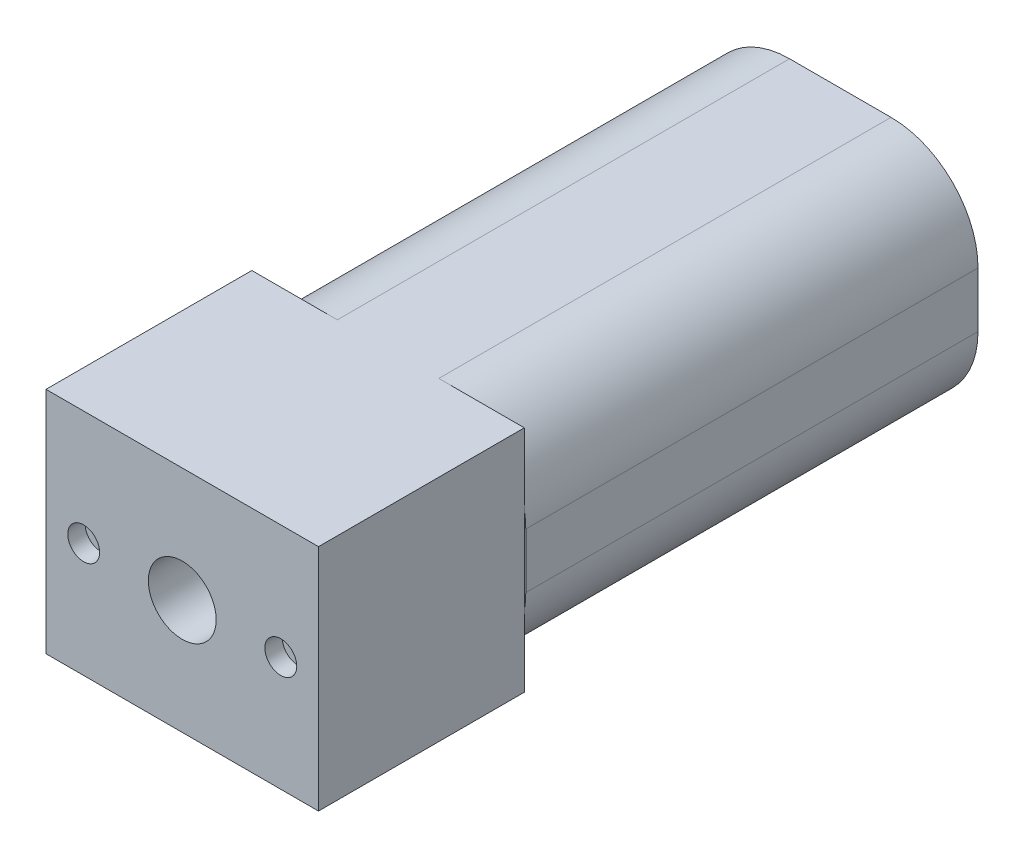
ISO-10303-21;
HEADER;
FILE_DESCRIPTION(('STEP AP214'),'2;1');
FILE_NAME('part.step','',(''),(''),'','','');
FILE_SCHEMA(('AUTOMOTIVE_DESIGN { 1 0 10303 214 1 1 1 1 }'));
ENDSEC;
DATA;
#1=APPLICATION_CONTEXT('core data for automotive mechanical design processes');
#2=APPLICATION_PROTOCOL_DEFINITION('international standard','automotive_design',2000,#1);
#3=PRODUCT_CONTEXT('',#1,'mechanical');
#4=PRODUCT('Part','Part','',(#3));
#5=PRODUCT_RELATED_PRODUCT_CATEGORY('part','',(#4));
#6=PRODUCT_DEFINITION_FORMATION('','',#4);
#7=PRODUCT_DEFINITION_CONTEXT('part definition',#1,'design');
#8=PRODUCT_DEFINITION('design','',#6,#7);
#9=PRODUCT_DEFINITION_SHAPE('','',#8);
#10=(LENGTH_UNIT() NAMED_UNIT(*) SI_UNIT(.MILLI.,.METRE.));
#11=(NAMED_UNIT(*) PLANE_ANGLE_UNIT() SI_UNIT($,.RADIAN.));
#12=(NAMED_UNIT(*) SI_UNIT($,.STERADIAN.) SOLID_ANGLE_UNIT());
#13=UNCERTAINTY_MEASURE_WITH_UNIT(LENGTH_MEASURE(1.E-05),#10,'distance_accuracy_value','');
#14=(GEOMETRIC_REPRESENTATION_CONTEXT(3) GLOBAL_UNCERTAINTY_ASSIGNED_CONTEXT((#13)) GLOBAL_UNIT_ASSIGNED_CONTEXT((#10,
#11,#12)) REPRESENTATION_CONTEXT('',''));
#15=CARTESIAN_POINT('',(0.,0.,0.));
#16=DIRECTION('',(0.,0.,1.));
#17=DIRECTION('',(1.,0.,0.));
#18=AXIS2_PLACEMENT_3D('',#15,#16,#17);
#19=CARTESIAN_POINT('',(-2.2225,1.2065,19.812));
#20=DIRECTION('',(0.,0.,-1.));
#21=DIRECTION('',(-1.,0.,0.));
#22=AXIS2_PLACEMENT_3D('',#19,#20,#21);
#23=PLANE('',#22);
#24=DIRECTION('',(0.,-1.,0.));
#25=VECTOR('',#24,1.);
#26=CARTESIAN_POINT('',(-5.969,5.0165,19.812));
#27=LINE('',#26,#25);
#28=CARTESIAN_POINT('',(-5.969,1.89920321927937,19.812));
#29=VERTEX_POINT('',#28);
#30=CARTESIAN_POINT('',(-5.969,-1.89920321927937,19.812));
#31=VERTEX_POINT('',#30);
#32=EDGE_CURVE('E11',#29,#31,#27,.T.);
#33=ORIENTED_EDGE('',*,*,#32,.F.);
#34=CARTESIAN_POINT('',(-2.2225,1.2065,19.812));
#35=DIRECTION('',(0.,0.,1.));
#36=DIRECTION('',(-1.,0.,0.));
#37=AXIS2_PLACEMENT_3D('',#34,#35,#36);
#38=CIRCLE('',#37,3.81);
#39=CARTESIAN_POINT('',(-6.0325,1.20649999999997,19.812));
#40=VERTEX_POINT('',#39);
#41=EDGE_CURVE('E177',#29,#40,#38,.T.);
#42=ORIENTED_EDGE('',*,*,#41,.T.);
#43=DIRECTION('',(0.,-1.,0.));
#44=VECTOR('',#43,1.);
#45=CARTESIAN_POINT('',(-6.0325,-1.20649999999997,19.812));
#46=LINE('',#45,#44);
#47=CARTESIAN_POINT('',(-6.0325,-1.20649999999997,19.812));
#48=VERTEX_POINT('',#47);
#49=EDGE_CURVE('E176',#40,#48,#46,.T.);
#50=ORIENTED_EDGE('',*,*,#49,.T.);
#51=CARTESIAN_POINT('',(-2.2225,-1.2065,19.812));
#52=DIRECTION('',(0.,0.,1.));
#53=DIRECTION('',(-1.,0.,0.));
#54=AXIS2_PLACEMENT_3D('',#51,#52,#53);
#55=CIRCLE('',#54,3.81);
#56=EDGE_CURVE('E179',#48,#31,#55,.T.);
#57=ORIENTED_EDGE('',*,*,#56,.T.);
#58=EDGE_LOOP('',(#33,#42,#50,#57));
#59=FACE_BOUND('',#58,.T.);
#60=ADVANCED_FACE('F33',(#59),#23,.F.);
#61=DIRECTION('',(0.,1.,0.));
#62=VECTOR('',#61,1.);
#63=CARTESIAN_POINT('',(5.969,5.0165,19.812));
#64=LINE('',#63,#62);
#65=CARTESIAN_POINT('',(5.969,-1.89920321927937,19.812));
#66=VERTEX_POINT('',#65);
#67=CARTESIAN_POINT('',(5.969,1.89920321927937,19.812));
#68=VERTEX_POINT('',#67);
#69=EDGE_CURVE('E42',#66,#68,#64,.T.);
#70=ORIENTED_EDGE('',*,*,#69,.F.);
#71=CARTESIAN_POINT('',(2.2225,-1.2065,19.812));
#72=DIRECTION('',(0.,0.,1.));
#73=DIRECTION('',(1.,0.,0.));
#74=AXIS2_PLACEMENT_3D('',#71,#72,#73);
#75=CIRCLE('',#74,3.81);
#76=CARTESIAN_POINT('',(6.0325,-1.2065,19.812));
#77=VERTEX_POINT('',#76);
#78=EDGE_CURVE('E181',#66,#77,#75,.T.);
#79=ORIENTED_EDGE('',*,*,#78,.T.);
#80=DIRECTION('',(0.,1.,0.));
#81=VECTOR('',#80,1.);
#82=CARTESIAN_POINT('',(6.0325,-1.20649999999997,19.812));
#83=LINE('',#82,#81);
#84=CARTESIAN_POINT('',(6.0325,1.20649999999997,19.812));
#85=VERTEX_POINT('',#84);
#86=EDGE_CURVE('E185',#77,#85,#83,.T.);
#87=ORIENTED_EDGE('',*,*,#86,.T.);
#88=CARTESIAN_POINT('',(2.2225,1.2065,19.812));
#89=DIRECTION('',(0.,0.,1.));
#90=DIRECTION('',(-1.,0.,0.));
#91=AXIS2_PLACEMENT_3D('',#88,#89,#90);
#92=CIRCLE('',#91,3.81);
#93=EDGE_CURVE('E188',#85,#68,#92,.T.);
#94=ORIENTED_EDGE('',*,*,#93,.T.);
#95=EDGE_LOOP('',(#70,#79,#87,#94));
#96=FACE_BOUND('',#95,.T.);
#97=ADVANCED_FACE('F300',(#96),#23,.F.);
#98=CARTESIAN_POINT('',(-2.2225,1.2065,19.812));
#99=DIRECTION('',(0.,0.,-1.));
#100=DIRECTION('',(-1.,0.,0.));
#101=AXIS2_PLACEMENT_3D('',#98,#99,#100);
#102=CYLINDRICAL_SURFACE('',#101,3.81);
#103=CARTESIAN_POINT('',(-2.2225,1.2065,0.));
#104=DIRECTION('',(0.,0.,1.));
#105=DIRECTION('',(-1.,0.,0.));
#106=AXIS2_PLACEMENT_3D('',#103,#104,#105);
#107=CIRCLE('',#106,3.81);
#108=CARTESIAN_POINT('',(-2.22249999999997,5.0165,0.));
#109=VERTEX_POINT('',#108);
#110=CARTESIAN_POINT('',(-6.0325,1.20649999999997,0.));
#111=VERTEX_POINT('',#110);
#112=EDGE_CURVE('E164',#109,#111,#107,.T.);
#113=ORIENTED_EDGE('',*,*,#112,.T.);
#114=DIRECTION('',(0.,0.,-1.));
#115=VECTOR('',#114,1.);
#116=CARTESIAN_POINT('',(-6.0325,1.20649999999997,19.812));
#117=LINE('',#116,#115);
#118=EDGE_CURVE('E37',#40,#111,#117,.T.);
#119=ORIENTED_EDGE('',*,*,#118,.F.);
#120=ORIENTED_EDGE('',*,*,#41,.F.);
#121=CARTESIAN_POINT('',(-2.22249999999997,5.0165,19.812));
#122=VERTEX_POINT('',#121);
#123=EDGE_CURVE('E173',#122,#29,#38,.T.);
#124=ORIENTED_EDGE('',*,*,#123,.F.);
#125=DIRECTION('',(0.,0.,-1.));
#126=VECTOR('',#125,1.);
#127=CARTESIAN_POINT('',(-2.22249999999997,5.0165,19.812));
#128=LINE('',#127,#126);
#129=EDGE_CURVE('E189',#122,#109,#128,.T.);
#130=ORIENTED_EDGE('',*,*,#129,.T.);
#131=EDGE_LOOP('',(#113,#119,#120,#124,#130));
#132=FACE_BOUND('',#131,.T.);
#133=ADVANCED_FACE('F35',(#132),#102,.T.);
#134=CARTESIAN_POINT('',(-6.0325,-1.20649999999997,19.812));
#135=DIRECTION('',(1.,0.,0.));
#136=DIRECTION('',(0.,0.,-1.));
#137=AXIS2_PLACEMENT_3D('',#134,#135,#136);
#138=PLANE('',#137);
#139=DIRECTION('',(0.,-1.,0.));
#140=VECTOR('',#139,1.);
#141=CARTESIAN_POINT('',(-6.0325,-1.20649999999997,0.));
#142=LINE('',#141,#140);
#143=CARTESIAN_POINT('',(-6.0325,-1.20649999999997,0.));
#144=VERTEX_POINT('',#143);
#145=EDGE_CURVE('E167',#111,#144,#142,.T.);
#146=ORIENTED_EDGE('',*,*,#145,.T.);
#147=DIRECTION('',(0.,0.,-1.));
#148=VECTOR('',#147,1.);
#149=CARTESIAN_POINT('',(-6.0325,-1.20649999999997,19.812));
#150=LINE('',#149,#148);
#151=EDGE_CURVE('E220',#48,#144,#150,.T.);
#152=ORIENTED_EDGE('',*,*,#151,.F.);
#153=ORIENTED_EDGE('',*,*,#49,.F.);
#154=ORIENTED_EDGE('',*,*,#118,.T.);
#155=EDGE_LOOP('',(#146,#152,#153,#154));
#156=FACE_BOUND('',#155,.T.);
#157=ADVANCED_FACE('F334',(#156),#138,.F.);
#158=CARTESIAN_POINT('',(-2.2225,-1.2065,19.812));
#159=DIRECTION('',(0.,0.,-1.));
#160=DIRECTION('',(-1.,0.,0.));
#161=AXIS2_PLACEMENT_3D('',#158,#159,#160);
#162=CYLINDRICAL_SURFACE('',#161,3.81);
#163=CARTESIAN_POINT('',(-2.2225,-1.2065,0.));
#164=DIRECTION('',(0.,0.,1.));
#165=DIRECTION('',(-1.,0.,0.));
#166=AXIS2_PLACEMENT_3D('',#163,#164,#165);
#167=CIRCLE('',#166,3.81);
#168=CARTESIAN_POINT('',(-2.22249999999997,-5.0165,0.));
#169=VERTEX_POINT('',#168);
#170=EDGE_CURVE('E192',#144,#169,#167,.T.);
#171=ORIENTED_EDGE('',*,*,#170,.T.);
#172=DIRECTION('',(0.,0.,-1.));
#173=VECTOR('',#172,1.);
#174=CARTESIAN_POINT('',(-2.22249999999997,-5.0165,19.812));
#175=LINE('',#174,#173);
#176=CARTESIAN_POINT('',(-2.22249999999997,-5.0165,19.812));
#177=VERTEX_POINT('',#176);
#178=EDGE_CURVE('E218',#177,#169,#175,.T.);
#179=ORIENTED_EDGE('',*,*,#178,.F.);
#180=EDGE_CURVE('E59',#31,#177,#55,.T.);
#181=ORIENTED_EDGE('',*,*,#180,.F.);
#182=ORIENTED_EDGE('',*,*,#56,.F.);
#183=ORIENTED_EDGE('',*,*,#151,.T.);
#184=EDGE_LOOP('',(#171,#179,#181,#182,#183));
#185=FACE_BOUND('',#184,.T.);
#186=ADVANCED_FACE('F332',(#185),#162,.T.);
#187=CARTESIAN_POINT('',(-2.22249999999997,-5.0165,19.812));
#188=DIRECTION('',(0.,1.,0.));
#189=DIRECTION('',(0.,0.,1.));
#190=AXIS2_PLACEMENT_3D('',#187,#188,#189);
#191=PLANE('',#190);
#192=DIRECTION('',(1.,0.,0.));
#193=VECTOR('',#192,1.);
#194=CARTESIAN_POINT('',(-2.22249999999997,-5.0165,0.));
#195=LINE('',#194,#193);
#196=CARTESIAN_POINT('',(2.22249999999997,-5.0165,0.));
#197=VERTEX_POINT('',#196);
#198=EDGE_CURVE('E194',#169,#197,#195,.T.);
#199=ORIENTED_EDGE('',*,*,#198,.T.);
#200=DIRECTION('',(0.,0.,-1.));
#201=VECTOR('',#200,1.);
#202=CARTESIAN_POINT('',(2.22249999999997,-5.0165,19.812));
#203=LINE('',#202,#201);
#204=CARTESIAN_POINT('',(2.22249999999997,-5.0165,19.812));
#205=VERTEX_POINT('',#204);
#206=EDGE_CURVE('E215',#205,#197,#203,.T.);
#207=ORIENTED_EDGE('',*,*,#206,.F.);
#208=DIRECTION('',(1.,0.,0.));
#209=VECTOR('',#208,1.);
#210=CARTESIAN_POINT('',(5.969,-5.0165,19.812));
#211=LINE('',#210,#209);
#212=CARTESIAN_POINT('',(5.969,-5.0165,19.812));
#213=VERTEX_POINT('',#212);
#214=EDGE_CURVE('E240',#205,#213,#211,.T.);
#215=ORIENTED_EDGE('',*,*,#214,.T.);
#216=DIRECTION('',(0.,0.,-1.));
#217=VECTOR('',#216,1.);
#218=CARTESIAN_POINT('',(5.969,-5.0165,28.829));
#219=LINE('',#218,#217);
#220=CARTESIAN_POINT('',(5.969,-5.0165,28.829));
#221=VERTEX_POINT('',#220);
#222=EDGE_CURVE('E145',#221,#213,#219,.T.);
#223=ORIENTED_EDGE('',*,*,#222,.F.);
#224=DIRECTION('',(1.,0.,0.));
#225=VECTOR('',#224,1.);
#226=CARTESIAN_POINT('',(5.969,-5.0165,28.829));
#227=LINE('',#226,#225);
#228=CARTESIAN_POINT('',(-5.969,-5.0165,28.829));
#229=VERTEX_POINT('',#228);
#230=EDGE_CURVE('E138',#229,#221,#227,.T.);
#231=ORIENTED_EDGE('',*,*,#230,.F.);
#232=DIRECTION('',(0.,0.,-1.));
#233=VECTOR('',#232,1.);
#234=CARTESIAN_POINT('',(-5.969,-5.0165,28.829));
#235=LINE('',#234,#233);
#236=CARTESIAN_POINT('',(-5.969,-5.0165,19.812));
#237=VERTEX_POINT('',#236);
#238=EDGE_CURVE('E143',#229,#237,#235,.T.);
#239=ORIENTED_EDGE('',*,*,#238,.T.);
#240=EDGE_CURVE('E236',#237,#177,#211,.T.);
#241=ORIENTED_EDGE('',*,*,#240,.T.);
#242=ORIENTED_EDGE('',*,*,#178,.T.);
#243=EDGE_LOOP('',(#199,#207,#215,#223,#231,#239,#241,#242));
#244=FACE_BOUND('',#243,.T.);
#245=ADVANCED_FACE('F140',(#244),#191,.F.);
#246=CARTESIAN_POINT('',(2.2225,-1.2065,19.812));
#247=DIRECTION('',(0.,0.,-1.));
#248=DIRECTION('',(-1.,0.,0.));
#249=AXIS2_PLACEMENT_3D('',#246,#247,#248);
#250=CYLINDRICAL_SURFACE('',#249,3.81);
#251=CARTESIAN_POINT('',(2.2225,-1.2065,0.));
#252=DIRECTION('',(0.,0.,1.));
#253=DIRECTION('',(1.,0.,0.));
#254=AXIS2_PLACEMENT_3D('',#251,#252,#253);
#255=CIRCLE('',#254,3.81);
#256=CARTESIAN_POINT('',(6.0325,-1.2065,0.));
#257=VERTEX_POINT('',#256);
#258=EDGE_CURVE('E196',#197,#257,#255,.T.);
#259=ORIENTED_EDGE('',*,*,#258,.T.);
#260=DIRECTION('',(0.,0.,-1.));
#261=VECTOR('',#260,1.);
#262=CARTESIAN_POINT('',(6.0325,-1.2065,19.812));
#263=LINE('',#262,#261);
#264=EDGE_CURVE('E212',#77,#257,#263,.T.);
#265=ORIENTED_EDGE('',*,*,#264,.F.);
#266=ORIENTED_EDGE('',*,*,#78,.F.);
#267=EDGE_CURVE('E182',#205,#66,#75,.T.);
#268=ORIENTED_EDGE('',*,*,#267,.F.);
#269=ORIENTED_EDGE('',*,*,#206,.T.);
#270=EDGE_LOOP('',(#259,#265,#266,#268,#269));
#271=FACE_BOUND('',#270,.T.);
#272=ADVANCED_FACE('F325',(#271),#250,.T.);
#273=CARTESIAN_POINT('',(6.0325,-1.20649999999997,19.812));
#274=DIRECTION('',(-1.,0.,0.));
#275=DIRECTION('',(0.,0.,1.));
#276=AXIS2_PLACEMENT_3D('',#273,#274,#275);
#277=PLANE('',#276);
#278=DIRECTION('',(0.,1.,0.));
#279=VECTOR('',#278,1.);
#280=CARTESIAN_POINT('',(6.0325,-1.20649999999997,0.));
#281=LINE('',#280,#279);
#282=CARTESIAN_POINT('',(6.0325,1.20649999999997,0.));
#283=VERTEX_POINT('',#282);
#284=EDGE_CURVE('E198',#257,#283,#281,.T.);
#285=ORIENTED_EDGE('',*,*,#284,.T.);
#286=DIRECTION('',(0.,0.,-1.));
#287=VECTOR('',#286,1.);
#288=CARTESIAN_POINT('',(6.0325,1.20649999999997,19.812));
#289=LINE('',#288,#287);
#290=EDGE_CURVE('E209',#85,#283,#289,.T.);
#291=ORIENTED_EDGE('',*,*,#290,.F.);
#292=ORIENTED_EDGE('',*,*,#86,.F.);
#293=ORIENTED_EDGE('',*,*,#264,.T.);
#294=EDGE_LOOP('',(#285,#291,#292,#293));
#295=FACE_BOUND('',#294,.T.);
#296=ADVANCED_FACE('F321',(#295),#277,.F.);
#297=CARTESIAN_POINT('',(2.2225,1.2065,19.812));
#298=DIRECTION('',(0.,0.,-1.));
#299=DIRECTION('',(-1.,0.,0.));
#300=AXIS2_PLACEMENT_3D('',#297,#298,#299);
#301=CYLINDRICAL_SURFACE('',#300,3.81);
#302=CARTESIAN_POINT('',(2.2225,1.2065,0.));
#303=DIRECTION('',(0.,0.,1.));
#304=DIRECTION('',(-1.,0.,0.));
#305=AXIS2_PLACEMENT_3D('',#302,#303,#304);
#306=CIRCLE('',#305,3.81);
#307=CARTESIAN_POINT('',(2.22249999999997,5.0165,0.));
#308=VERTEX_POINT('',#307);
#309=EDGE_CURVE('E200',#283,#308,#306,.T.);
#310=ORIENTED_EDGE('',*,*,#309,.T.);
#311=DIRECTION('',(0.,0.,-1.));
#312=VECTOR('',#311,1.);
#313=CARTESIAN_POINT('',(2.22249999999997,5.0165,19.812));
#314=LINE('',#313,#312);
#315=CARTESIAN_POINT('',(2.22249999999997,5.0165,19.812));
#316=VERTEX_POINT('',#315);
#317=EDGE_CURVE('E206',#316,#308,#314,.T.);
#318=ORIENTED_EDGE('',*,*,#317,.F.);
#319=EDGE_CURVE('E187',#68,#316,#92,.T.);
#320=ORIENTED_EDGE('',*,*,#319,.F.);
#321=ORIENTED_EDGE('',*,*,#93,.F.);
#322=ORIENTED_EDGE('',*,*,#290,.T.);
#323=EDGE_LOOP('',(#310,#318,#320,#321,#322));
#324=FACE_BOUND('',#323,.T.);
#325=ADVANCED_FACE('F317',(#324),#301,.T.);
#326=CARTESIAN_POINT('',(-2.22249999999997,5.0165,19.812));
#327=DIRECTION('',(0.,-1.,0.));
#328=DIRECTION('',(0.,0.,-1.));
#329=AXIS2_PLACEMENT_3D('',#326,#327,#328);
#330=PLANE('',#329);
#331=DIRECTION('',(-1.,0.,0.));
#332=VECTOR('',#331,1.);
#333=CARTESIAN_POINT('',(-2.22249999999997,5.0165,0.));
#334=LINE('',#333,#332);
#335=EDGE_CURVE('E202',#308,#109,#334,.T.);
#336=ORIENTED_EDGE('',*,*,#335,.T.);
#337=ORIENTED_EDGE('',*,*,#129,.F.);
#338=DIRECTION('',(-1.,0.,0.));
#339=VECTOR('',#338,1.);
#340=CARTESIAN_POINT('',(5.969,5.0165,19.812));
#341=LINE('',#340,#339);
#342=CARTESIAN_POINT('',(-5.969,5.0165,19.812));
#343=VERTEX_POINT('',#342);
#344=EDGE_CURVE('E235',#122,#343,#341,.T.);
#345=ORIENTED_EDGE('',*,*,#344,.T.);
#346=DIRECTION('',(0.,0.,-1.));
#347=VECTOR('',#346,1.);
#348=CARTESIAN_POINT('',(-5.969,5.0165,28.829));
#349=LINE('',#348,#347);
#350=CARTESIAN_POINT('',(-5.969,5.0165,28.829));
#351=VERTEX_POINT('',#350);
#352=EDGE_CURVE('E243',#351,#343,#349,.T.);
#353=ORIENTED_EDGE('',*,*,#352,.F.);
#354=DIRECTION('',(-1.,0.,0.));
#355=VECTOR('',#354,1.);
#356=CARTESIAN_POINT('',(5.969,5.0165,28.829));
#357=LINE('',#356,#355);
#358=CARTESIAN_POINT('',(5.969,5.0165,28.829));
#359=VERTEX_POINT('',#358);
#360=EDGE_CURVE('E154',#359,#351,#357,.T.);
#361=ORIENTED_EDGE('',*,*,#360,.F.);
#362=DIRECTION('',(0.,0.,-1.));
#363=VECTOR('',#362,1.);
#364=CARTESIAN_POINT('',(5.969,5.0165,28.829));
#365=LINE('',#364,#363);
#366=CARTESIAN_POINT('',(5.969,5.0165,19.812));
#367=VERTEX_POINT('',#366);
#368=EDGE_CURVE('E169',#359,#367,#365,.T.);
#369=ORIENTED_EDGE('',*,*,#368,.T.);
#370=EDGE_CURVE('E158',#367,#316,#341,.T.);
#371=ORIENTED_EDGE('',*,*,#370,.T.);
#372=ORIENTED_EDGE('',*,*,#317,.T.);
#373=EDGE_LOOP('',(#336,#337,#345,#353,#361,#369,#371,#372));
#374=FACE_BOUND('',#373,.T.);
#375=ADVANCED_FACE('F313',(#374),#330,.F.);
#376=CARTESIAN_POINT('',(-2.2225,1.2065,0.));
#377=DIRECTION('',(0.,0.,-1.));
#378=DIRECTION('',(-1.,0.,0.));
#379=AXIS2_PLACEMENT_3D('',#376,#377,#378);
#380=PLANE('',#379);
#381=ORIENTED_EDGE('',*,*,#112,.F.);
#382=ORIENTED_EDGE('',*,*,#335,.F.);
#383=ORIENTED_EDGE('',*,*,#309,.F.);
#384=ORIENTED_EDGE('',*,*,#284,.F.);
#385=ORIENTED_EDGE('',*,*,#258,.F.);
#386=ORIENTED_EDGE('',*,*,#198,.F.);
#387=ORIENTED_EDGE('',*,*,#170,.F.);
#388=ORIENTED_EDGE('',*,*,#145,.F.);
#389=EDGE_LOOP('',(#381,#382,#383,#384,#385,#386,#387,#388));
#390=FACE_BOUND('',#389,.T.);
#391=ADVANCED_FACE('F310',(#390),#380,.T.);
#392=CARTESIAN_POINT('',(0.,0.,19.812));
#393=DIRECTION('',(0.,0.,-1.));
#394=DIRECTION('',(-1.,0.,0.));
#395=AXIS2_PLACEMENT_3D('',#392,#393,#394);
#396=PLANE('',#395);
#397=ORIENTED_EDGE('',*,*,#344,.F.);
#398=ORIENTED_EDGE('',*,*,#123,.T.);
#399=EDGE_CURVE('E44',#343,#29,#27,.T.);
#400=ORIENTED_EDGE('',*,*,#399,.F.);
#401=EDGE_LOOP('',(#397,#398,#400));
#402=FACE_BOUND('',#401,.T.);
#403=ADVANCED_FACE('F296',(#402),#396,.T.);
#404=EDGE_CURVE('E45',#31,#237,#27,.T.);
#405=ORIENTED_EDGE('',*,*,#404,.F.);
#406=ORIENTED_EDGE('',*,*,#180,.T.);
#407=ORIENTED_EDGE('',*,*,#240,.F.);
#408=EDGE_LOOP('',(#405,#406,#407));
#409=FACE_BOUND('',#408,.T.);
#410=ADVANCED_FACE('F367',(#409),#396,.T.);
#411=ORIENTED_EDGE('',*,*,#214,.F.);
#412=ORIENTED_EDGE('',*,*,#267,.T.);
#413=EDGE_CURVE('E229',#213,#66,#64,.T.);
#414=ORIENTED_EDGE('',*,*,#413,.F.);
#415=EDGE_LOOP('',(#411,#412,#414));
#416=FACE_BOUND('',#415,.T.);
#417=ADVANCED_FACE('F297',(#416),#396,.T.);
#418=CARTESIAN_POINT('',(-5.969,5.0165,28.829));
#419=DIRECTION('',(1.,0.,0.));
#420=DIRECTION('',(0.,1.,0.));
#421=AXIS2_PLACEMENT_3D('',#418,#419,#420);
#422=PLANE('',#421);
#423=ORIENTED_EDGE('',*,*,#399,.T.);
#424=ORIENTED_EDGE('',*,*,#32,.T.);
#425=ORIENTED_EDGE('',*,*,#404,.T.);
#426=ORIENTED_EDGE('',*,*,#238,.F.);
#427=DIRECTION('',(0.,-1.,0.));
#428=VECTOR('',#427,1.);
#429=CARTESIAN_POINT('',(-5.969,5.0165,28.829));
#430=LINE('',#429,#428);
#431=EDGE_CURVE('E149',#351,#229,#430,.T.);
#432=ORIENTED_EDGE('',*,*,#431,.F.);
#433=ORIENTED_EDGE('',*,*,#352,.T.);
#434=EDGE_LOOP('',(#423,#424,#425,#426,#432,#433));
#435=FACE_BOUND('',#434,.T.);
#436=ADVANCED_FACE('F161',(#435),#422,.F.);
#437=CARTESIAN_POINT('',(5.969,5.0165,28.829));
#438=DIRECTION('',(-1.,0.,0.));
#439=DIRECTION('',(0.,0.,1.));
#440=AXIS2_PLACEMENT_3D('',#437,#438,#439);
#441=PLANE('',#440);
#442=ORIENTED_EDGE('',*,*,#413,.T.);
#443=ORIENTED_EDGE('',*,*,#69,.T.);
#444=EDGE_CURVE('E230',#68,#367,#64,.T.);
#445=ORIENTED_EDGE('',*,*,#444,.T.);
#446=ORIENTED_EDGE('',*,*,#368,.F.);
#447=DIRECTION('',(0.,1.,0.));
#448=VECTOR('',#447,1.);
#449=CARTESIAN_POINT('',(5.969,5.0165,28.829));
#450=LINE('',#449,#448);
#451=EDGE_CURVE('E148',#221,#359,#450,.T.);
#452=ORIENTED_EDGE('',*,*,#451,.F.);
#453=ORIENTED_EDGE('',*,*,#222,.T.);
#454=EDGE_LOOP('',(#442,#443,#445,#446,#452,#453));
#455=FACE_BOUND('',#454,.T.);
#456=ADVANCED_FACE('F276',(#455),#441,.F.);
#457=CARTESIAN_POINT('',(0.,0.,28.829));
#458=DIRECTION('',(0.,0.,-1.));
#459=DIRECTION('',(-1.,0.,0.));
#460=AXIS2_PLACEMENT_3D('',#457,#458,#459);
#461=PLANE('',#460);
#462=CARTESIAN_POINT('',(-4.318,0.,28.829));
#463=DIRECTION('',(0.,0.,1.));
#464=DIRECTION('',(1.,0.,0.));
#465=AXIS2_PLACEMENT_3D('',#462,#463,#464);
#466=CIRCLE('',#465,0.6985);
#467=CARTESIAN_POINT('',(-3.6195,0.,28.829));
#468=VERTEX_POINT('',#467);
#469=EDGE_CURVE('E258',#468,#468,#466,.T.);
#470=ORIENTED_EDGE('',*,*,#469,.F.);
#471=EDGE_LOOP('',(#470));
#472=FACE_BOUND('',#471,.T.);
#473=CARTESIAN_POINT('',(4.318,0.,28.829));
#474=DIRECTION('',(0.,0.,1.));
#475=DIRECTION('',(1.,0.,0.));
#476=AXIS2_PLACEMENT_3D('',#473,#474,#475);
#477=CIRCLE('',#476,0.6985);
#478=CARTESIAN_POINT('',(5.0165,0.,28.829));
#479=VERTEX_POINT('',#478);
#480=EDGE_CURVE('E252',#479,#479,#477,.T.);
#481=ORIENTED_EDGE('',*,*,#480,.F.);
#482=EDGE_LOOP('',(#481));
#483=FACE_BOUND('',#482,.T.);
#484=CARTESIAN_POINT('',(0.,0.,28.829));
#485=DIRECTION('',(0.,0.,1.));
#486=DIRECTION('',(1.,0.,0.));
#487=AXIS2_PLACEMENT_3D('',#484,#485,#486);
#488=CIRCLE('',#487,1.4859);
#489=CARTESIAN_POINT('',(1.4859,0.,28.829));
#490=VERTEX_POINT('',#489);
#491=EDGE_CURVE('E245',#490,#490,#488,.T.);
#492=ORIENTED_EDGE('',*,*,#491,.F.);
#493=EDGE_LOOP('',(#492));
#494=FACE_BOUND('',#493,.T.);
#495=ORIENTED_EDGE('',*,*,#431,.T.);
#496=ORIENTED_EDGE('',*,*,#230,.T.);
#497=ORIENTED_EDGE('',*,*,#451,.T.);
#498=ORIENTED_EDGE('',*,*,#360,.T.);
#499=EDGE_LOOP('',(#495,#496,#497,#498));
#500=FACE_BOUND('',#499,.T.);
#501=ADVANCED_FACE('F152',(#472,#483,#494,#500),#461,.F.);
#502=ORIENTED_EDGE('',*,*,#444,.F.);
#503=ORIENTED_EDGE('',*,*,#319,.T.);
#504=ORIENTED_EDGE('',*,*,#370,.F.);
#505=EDGE_LOOP('',(#502,#503,#504));
#506=FACE_BOUND('',#505,.T.);
#507=ADVANCED_FACE('F275',(#506),#396,.T.);
#508=CARTESIAN_POINT('',(0.,0.,21.209));
#509=DIRECTION('',(0.,0.,1.));
#510=DIRECTION('',(1.,0.,0.));
#511=AXIS2_PLACEMENT_3D('',#508,#509,#510);
#512=CYLINDRICAL_SURFACE('',#511,1.4859);
#513=CARTESIAN_POINT('',(0.,0.,21.209));
#514=DIRECTION('',(0.,0.,1.));
#515=DIRECTION('',(1.,0.,0.));
#516=AXIS2_PLACEMENT_3D('',#513,#514,#515);
#517=CIRCLE('',#516,1.4859);
#518=CARTESIAN_POINT('',(1.4859,0.,21.209));
#519=VERTEX_POINT('',#518);
#520=EDGE_CURVE('E248',#519,#519,#517,.T.);
#521=CARTESIAN_POINT('',(1.4859,0.,21.209));
#522=CARTESIAN_POINT('',(1.4859,0.,21.288375));
#523=CARTESIAN_POINT('',(1.4859,0.,21.36775));
#524=CARTESIAN_POINT('',(1.4859,0.,21.5265));
#525=CARTESIAN_POINT('',(1.4859,0.,21.605875));
#526=CARTESIAN_POINT('',(1.4859,0.,21.764625));
#527=CARTESIAN_POINT('',(1.4859,0.,21.844));
#528=CARTESIAN_POINT('',(1.4859,0.,22.00275));
#529=CARTESIAN_POINT('',(1.4859,0.,22.082125));
#530=CARTESIAN_POINT('',(1.4859,0.,22.240875));
#531=CARTESIAN_POINT('',(1.4859,0.,22.32025));
#532=CARTESIAN_POINT('',(1.4859,0.,22.479));
#533=CARTESIAN_POINT('',(1.4859,0.,22.558375));
#534=CARTESIAN_POINT('',(1.4859,0.,22.717125));
#535=CARTESIAN_POINT('',(1.4859,0.,22.7965));
#536=CARTESIAN_POINT('',(1.4859,0.,22.95525));
#537=CARTESIAN_POINT('',(1.4859,0.,23.034625));
#538=CARTESIAN_POINT('',(1.4859,0.,23.193375));
#539=CARTESIAN_POINT('',(1.4859,0.,23.27275));
#540=CARTESIAN_POINT('',(1.4859,0.,23.4315));
#541=CARTESIAN_POINT('',(1.4859,0.,23.510875));
#542=CARTESIAN_POINT('',(1.4859,0.,23.669625));
#543=CARTESIAN_POINT('',(1.4859,0.,23.749));
#544=CARTESIAN_POINT('',(1.4859,0.,23.90775));
#545=CARTESIAN_POINT('',(1.4859,0.,23.987125));
#546=CARTESIAN_POINT('',(1.4859,0.,24.145875));
#547=CARTESIAN_POINT('',(1.4859,0.,24.22525));
#548=CARTESIAN_POINT('',(1.4859,0.,24.384));
#549=CARTESIAN_POINT('',(1.4859,0.,24.463375));
#550=CARTESIAN_POINT('',(1.4859,0.,24.622125));
#551=CARTESIAN_POINT('',(1.4859,0.,24.7015));
#552=CARTESIAN_POINT('',(1.4859,0.,24.86025));
#553=CARTESIAN_POINT('',(1.4859,0.,24.939625));
#554=CARTESIAN_POINT('',(1.4859,0.,25.098375));
#555=CARTESIAN_POINT('',(1.4859,0.,25.17775));
#556=CARTESIAN_POINT('',(1.4859,0.,25.3365));
#557=CARTESIAN_POINT('',(1.4859,0.,25.415875));
#558=CARTESIAN_POINT('',(1.4859,0.,25.574625));
#559=CARTESIAN_POINT('',(1.4859,0.,25.654));
#560=CARTESIAN_POINT('',(1.4859,0.,25.81275));
#561=CARTESIAN_POINT('',(1.4859,0.,25.892125));
#562=CARTESIAN_POINT('',(1.4859,0.,26.050875));
#563=CARTESIAN_POINT('',(1.4859,0.,26.13025));
#564=CARTESIAN_POINT('',(1.4859,0.,26.289));
#565=CARTESIAN_POINT('',(1.4859,0.,26.368375));
#566=CARTESIAN_POINT('',(1.4859,0.,26.527125));
#567=CARTESIAN_POINT('',(1.4859,0.,26.6065));
#568=CARTESIAN_POINT('',(1.4859,0.,26.76525));
#569=CARTESIAN_POINT('',(1.4859,0.,26.844625));
#570=CARTESIAN_POINT('',(1.4859,0.,27.003375));
#571=CARTESIAN_POINT('',(1.4859,0.,27.08275));
#572=CARTESIAN_POINT('',(1.4859,0.,27.2415));
#573=CARTESIAN_POINT('',(1.4859,0.,27.320875));
#574=CARTESIAN_POINT('',(1.4859,0.,27.479625));
#575=CARTESIAN_POINT('',(1.4859,0.,27.559));
#576=CARTESIAN_POINT('',(1.4859,0.,27.71775));
#577=CARTESIAN_POINT('',(1.4859,0.,27.797125));
#578=CARTESIAN_POINT('',(1.4859,0.,27.955875));
#579=CARTESIAN_POINT('',(1.4859,0.,28.03525));
#580=CARTESIAN_POINT('',(1.4859,0.,28.194));
#581=CARTESIAN_POINT('',(1.4859,0.,28.273375));
#582=CARTESIAN_POINT('',(1.4859,0.,28.432125));
#583=CARTESIAN_POINT('',(1.4859,0.,28.5115));
#584=CARTESIAN_POINT('',(1.4859,0.,28.67025));
#585=CARTESIAN_POINT('',(1.4859,0.,28.749625));
#586=CARTESIAN_POINT('',(1.4859,0.,28.829));
#587=B_SPLINE_CURVE_WITH_KNOTS('',3,(#521,#522,#523,#524,#525,#526,#527,#528,#529,#530,#531,
#532,#533,#534,#535,#536,#537,#538,#539,#540,#541,#542,#543,#544,#545,#546,#547,#548,#549,#550,
#551,#552,#553,#554,#555,#556,#557,#558,#559,#560,#561,#562,#563,#564,#565,#566,#567,#568,#569,
#570,#571,#572,#573,#574,#575,#576,#577,#578,#579,#580,#581,#582,#583,#584,#585,#586),
.UNSPECIFIED.,.F.,.F.,(4,2,2,2,2,2,2,2,2,2,2,2,2,2,2,2,2,2,2,2,2,2,2,2,2,2,2,2,2,2,2,2,4),(0.,
0.238124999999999,0.476249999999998,0.714375,0.952499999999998,1.190625,1.42875,1.666875,1.905,
2.143125,2.38125,2.619375,2.8575,3.095625,3.33375,3.571875,3.81,4.048125,4.28624999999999,
4.524375,4.7625,5.000625,5.23875,5.476875,5.71499999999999,5.953125,6.19125,6.429375,6.6675,
6.905625,7.14374999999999,7.381875,7.61999999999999),.UNSPECIFIED.);
#588=EDGE_CURVE('BSEAM282',#519,#490,#587,.T.);
#589=ORIENTED_EDGE('',*,*,#520,.F.);
#590=ORIENTED_EDGE('',*,*,#491,.T.);
#591=ORIENTED_EDGE('',*,*,#588,.T.);
#592=ORIENTED_EDGE('',*,*,#588,.F.);
#593=EDGE_LOOP('',(#589,#591,#590,#592));
#594=FACE_BOUND('',#593,.T.);
#595=ADVANCED_FACE('F282',(#594),#512,.F.);
#596=CARTESIAN_POINT('',(0.,0.,21.209));
#597=DIRECTION('',(0.,0.,1.));
#598=DIRECTION('',(1.,0.,0.));
#599=AXIS2_PLACEMENT_3D('',#596,#597,#598);
#600=PLANE('',#599);
#601=ORIENTED_EDGE('',*,*,#520,.T.);
#602=EDGE_LOOP('',(#601));
#603=FACE_BOUND('',#602,.T.);
#604=ADVANCED_FACE('F284',(#603),#600,.T.);
#605=CARTESIAN_POINT('',(4.318,0.,28.067));
#606=DIRECTION('',(0.,0.,1.));
#607=DIRECTION('',(1.,0.,0.));
#608=AXIS2_PLACEMENT_3D('',#605,#606,#607);
#609=CYLINDRICAL_SURFACE('',#608,0.6985);
#610=CARTESIAN_POINT('',(4.318,0.,28.067));
#611=DIRECTION('',(0.,0.,1.));
#612=DIRECTION('',(1.,0.,0.));
#613=AXIS2_PLACEMENT_3D('',#610,#611,#612);
#614=CIRCLE('',#613,0.6985);
#615=CARTESIAN_POINT('',(5.0165,0.,28.067));
#616=VERTEX_POINT('',#615);
#617=EDGE_CURVE('E255',#616,#616,#614,.T.);
#618=CARTESIAN_POINT('',(5.0165,0.,28.067));
#619=CARTESIAN_POINT('',(5.0165,0.,28.0749375));
#620=CARTESIAN_POINT('',(5.0165,0.,28.082875));
#621=CARTESIAN_POINT('',(5.0165,0.,28.09875));
#622=CARTESIAN_POINT('',(5.0165,0.,28.1066875));
#623=CARTESIAN_POINT('',(5.0165,0.,28.1225625));
#624=CARTESIAN_POINT('',(5.0165,0.,28.1305));
#625=CARTESIAN_POINT('',(5.0165,0.,28.146375));
#626=CARTESIAN_POINT('',(5.0165,0.,28.1543125));
#627=CARTESIAN_POINT('',(5.0165,0.,28.1701875));
#628=CARTESIAN_POINT('',(5.0165,0.,28.178125));
#629=CARTESIAN_POINT('',(5.0165,0.,28.194));
#630=CARTESIAN_POINT('',(5.0165,0.,28.2019375));
#631=CARTESIAN_POINT('',(5.0165,0.,28.2178125));
#632=CARTESIAN_POINT('',(5.0165,0.,28.22575));
#633=CARTESIAN_POINT('',(5.0165,0.,28.241625));
#634=CARTESIAN_POINT('',(5.0165,0.,28.2495625));
#635=CARTESIAN_POINT('',(5.0165,0.,28.2654375));
#636=CARTESIAN_POINT('',(5.0165,0.,28.273375));
#637=CARTESIAN_POINT('',(5.0165,0.,28.28925));
#638=CARTESIAN_POINT('',(5.0165,0.,28.2971875));
#639=CARTESIAN_POINT('',(5.0165,0.,28.3130625));
#640=CARTESIAN_POINT('',(5.0165,0.,28.321));
#641=CARTESIAN_POINT('',(5.0165,0.,28.336875));
#642=CARTESIAN_POINT('',(5.0165,0.,28.3448125));
#643=CARTESIAN_POINT('',(5.0165,0.,28.3606875));
#644=CARTESIAN_POINT('',(5.0165,0.,28.368625));
#645=CARTESIAN_POINT('',(5.0165,0.,28.3845));
#646=CARTESIAN_POINT('',(5.0165,0.,28.3924375));
#647=CARTESIAN_POINT('',(5.0165,0.,28.4083125));
#648=CARTESIAN_POINT('',(5.0165,0.,28.41625));
#649=CARTESIAN_POINT('',(5.0165,0.,28.432125));
#650=CARTESIAN_POINT('',(5.0165,0.,28.4400625));
#651=CARTESIAN_POINT('',(5.0165,0.,28.4559375));
#652=CARTESIAN_POINT('',(5.0165,0.,28.463875));
#653=CARTESIAN_POINT('',(5.0165,0.,28.47975));
#654=CARTESIAN_POINT('',(5.0165,0.,28.4876875));
#655=CARTESIAN_POINT('',(5.0165,0.,28.5035625));
#656=CARTESIAN_POINT('',(5.0165,0.,28.5115));
#657=CARTESIAN_POINT('',(5.0165,0.,28.527375));
#658=CARTESIAN_POINT('',(5.0165,0.,28.5353125));
#659=CARTESIAN_POINT('',(5.0165,0.,28.5511875));
#660=CARTESIAN_POINT('',(5.0165,0.,28.559125));
#661=CARTESIAN_POINT('',(5.0165,0.,28.575));
#662=CARTESIAN_POINT('',(5.0165,0.,28.5829375));
#663=CARTESIAN_POINT('',(5.0165,0.,28.5988125));
#664=CARTESIAN_POINT('',(5.0165,0.,28.60675));
#665=CARTESIAN_POINT('',(5.0165,0.,28.622625));
#666=CARTESIAN_POINT('',(5.0165,0.,28.6305625));
#667=CARTESIAN_POINT('',(5.0165,0.,28.6464375));
#668=CARTESIAN_POINT('',(5.0165,0.,28.654375));
#669=CARTESIAN_POINT('',(5.0165,0.,28.67025));
#670=CARTESIAN_POINT('',(5.0165,0.,28.6781875));
#671=CARTESIAN_POINT('',(5.0165,0.,28.6940625));
#672=CARTESIAN_POINT('',(5.0165,0.,28.702));
#673=CARTESIAN_POINT('',(5.0165,0.,28.717875));
#674=CARTESIAN_POINT('',(5.0165,0.,28.7258125));
#675=CARTESIAN_POINT('',(5.0165,0.,28.7416875));
#676=CARTESIAN_POINT('',(5.0165,0.,28.749625));
#677=CARTESIAN_POINT('',(5.0165,0.,28.7655));
#678=CARTESIAN_POINT('',(5.0165,0.,28.7734375));
#679=CARTESIAN_POINT('',(5.0165,0.,28.7893125));
#680=CARTESIAN_POINT('',(5.0165,0.,28.79725));
#681=CARTESIAN_POINT('',(5.0165,0.,28.813125));
#682=CARTESIAN_POINT('',(5.0165,0.,28.8210625));
#683=CARTESIAN_POINT('',(5.0165,0.,28.829));
#684=B_SPLINE_CURVE_WITH_KNOTS('',3,(#618,#619,#620,#621,#622,#623,#624,#625,#626,#627,#628,
#629,#630,#631,#632,#633,#634,#635,#636,#637,#638,#639,#640,#641,#642,#643,#644,#645,#646,#647,
#648,#649,#650,#651,#652,#653,#654,#655,#656,#657,#658,#659,#660,#661,#662,#663,#664,#665,#666,
#667,#668,#669,#670,#671,#672,#673,#674,#675,#676,#677,#678,#679,#680,#681,#682,#683),
.UNSPECIFIED.,.F.,.F.,(4,2,2,2,2,2,2,2,2,2,2,2,2,2,2,2,2,2,2,2,2,2,2,2,2,2,2,2,2,2,2,2,4),(0.,
0.0238124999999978,0.0476249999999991,0.0714374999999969,0.0952499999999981,0.119062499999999,
0.142874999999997,0.166687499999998,0.190499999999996,0.214312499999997,0.238124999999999,
0.261937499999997,0.285749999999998,0.309562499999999,0.333374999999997,0.357187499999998,
0.380999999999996,0.404812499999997,0.428624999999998,0.452437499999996,0.476249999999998,
0.500062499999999,0.523874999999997,0.547687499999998,0.571499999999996,0.595312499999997,
0.619124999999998,0.642937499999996,0.666749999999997,0.690562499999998,0.714374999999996,
0.738187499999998,0.761999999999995),.UNSPECIFIED.);
#685=EDGE_CURVE('BSEAM291',#616,#479,#684,.T.);
#686=ORIENTED_EDGE('',*,*,#617,.F.);
#687=ORIENTED_EDGE('',*,*,#480,.T.);
#688=ORIENTED_EDGE('',*,*,#685,.T.);
#689=ORIENTED_EDGE('',*,*,#685,.F.);
#690=EDGE_LOOP('',(#686,#688,#687,#689));
#691=FACE_BOUND('',#690,.T.);
#692=ADVANCED_FACE('F291',(#691),#609,.F.);
#693=CARTESIAN_POINT('',(4.318,0.,28.067));
#694=DIRECTION('',(0.,0.,1.));
#695=DIRECTION('',(1.,0.,0.));
#696=AXIS2_PLACEMENT_3D('',#693,#694,#695);
#697=PLANE('',#696);
#698=ORIENTED_EDGE('',*,*,#617,.T.);
#699=EDGE_LOOP('',(#698));
#700=FACE_BOUND('',#699,.T.);
#701=ADVANCED_FACE('F269',(#700),#697,.T.);
#702=CARTESIAN_POINT('',(-4.318,0.,28.067));
#703=DIRECTION('',(0.,0.,1.));
#704=DIRECTION('',(1.,0.,0.));
#705=AXIS2_PLACEMENT_3D('',#702,#703,#704);
#706=CYLINDRICAL_SURFACE('',#705,0.6985);
#707=CARTESIAN_POINT('',(-4.318,0.,28.067));
#708=DIRECTION('',(0.,0.,1.));
#709=DIRECTION('',(1.,0.,0.));
#710=AXIS2_PLACEMENT_3D('',#707,#708,#709);
#711=CIRCLE('',#710,0.6985);
#712=CARTESIAN_POINT('',(-3.6195,0.,28.067));
#713=VERTEX_POINT('',#712);
#714=EDGE_CURVE('E249',#713,#713,#711,.T.);
#715=CARTESIAN_POINT('',(-3.6195,0.,28.067));
#716=CARTESIAN_POINT('',(-3.6195,0.,28.0749375));
#717=CARTESIAN_POINT('',(-3.6195,0.,28.082875));
#718=CARTESIAN_POINT('',(-3.6195,0.,28.09875));
#719=CARTESIAN_POINT('',(-3.6195,0.,28.1066875));
#720=CARTESIAN_POINT('',(-3.6195,0.,28.1225625));
#721=CARTESIAN_POINT('',(-3.6195,0.,28.1305));
#722=CARTESIAN_POINT('',(-3.6195,0.,28.146375));
#723=CARTESIAN_POINT('',(-3.6195,0.,28.1543125));
#724=CARTESIAN_POINT('',(-3.6195,0.,28.1701875));
#725=CARTESIAN_POINT('',(-3.6195,0.,28.178125));
#726=CARTESIAN_POINT('',(-3.6195,0.,28.194));
#727=CARTESIAN_POINT('',(-3.6195,0.,28.2019375));
#728=CARTESIAN_POINT('',(-3.6195,0.,28.2178125));
#729=CARTESIAN_POINT('',(-3.6195,0.,28.22575));
#730=CARTESIAN_POINT('',(-3.6195,0.,28.241625));
#731=CARTESIAN_POINT('',(-3.6195,0.,28.2495625));
#732=CARTESIAN_POINT('',(-3.6195,0.,28.2654375));
#733=CARTESIAN_POINT('',(-3.6195,0.,28.273375));
#734=CARTESIAN_POINT('',(-3.6195,0.,28.28925));
#735=CARTESIAN_POINT('',(-3.6195,0.,28.2971875));
#736=CARTESIAN_POINT('',(-3.6195,0.,28.3130625));
#737=CARTESIAN_POINT('',(-3.6195,0.,28.321));
#738=CARTESIAN_POINT('',(-3.6195,0.,28.336875));
#739=CARTESIAN_POINT('',(-3.6195,0.,28.3448125));
#740=CARTESIAN_POINT('',(-3.6195,0.,28.3606875));
#741=CARTESIAN_POINT('',(-3.6195,0.,28.368625));
#742=CARTESIAN_POINT('',(-3.6195,0.,28.3845));
#743=CARTESIAN_POINT('',(-3.6195,0.,28.3924375));
#744=CARTESIAN_POINT('',(-3.6195,0.,28.4083125));
#745=CARTESIAN_POINT('',(-3.6195,0.,28.41625));
#746=CARTESIAN_POINT('',(-3.6195,0.,28.432125));
#747=CARTESIAN_POINT('',(-3.6195,0.,28.4400625));
#748=CARTESIAN_POINT('',(-3.6195,0.,28.4559375));
#749=CARTESIAN_POINT('',(-3.6195,0.,28.463875));
#750=CARTESIAN_POINT('',(-3.6195,0.,28.47975));
#751=CARTESIAN_POINT('',(-3.6195,0.,28.4876875));
#752=CARTESIAN_POINT('',(-3.6195,0.,28.5035625));
#753=CARTESIAN_POINT('',(-3.6195,0.,28.5115));
#754=CARTESIAN_POINT('',(-3.6195,0.,28.527375));
#755=CARTESIAN_POINT('',(-3.6195,0.,28.5353125));
#756=CARTESIAN_POINT('',(-3.6195,0.,28.5511875));
#757=CARTESIAN_POINT('',(-3.6195,0.,28.559125));
#758=CARTESIAN_POINT('',(-3.6195,0.,28.575));
#759=CARTESIAN_POINT('',(-3.6195,0.,28.5829375));
#760=CARTESIAN_POINT('',(-3.6195,0.,28.5988125));
#761=CARTESIAN_POINT('',(-3.6195,0.,28.60675));
#762=CARTESIAN_POINT('',(-3.6195,0.,28.622625));
#763=CARTESIAN_POINT('',(-3.6195,0.,28.6305625));
#764=CARTESIAN_POINT('',(-3.6195,0.,28.6464375));
#765=CARTESIAN_POINT('',(-3.6195,0.,28.654375));
#766=CARTESIAN_POINT('',(-3.6195,0.,28.67025));
#767=CARTESIAN_POINT('',(-3.6195,0.,28.6781875));
#768=CARTESIAN_POINT('',(-3.6195,0.,28.6940625));
#769=CARTESIAN_POINT('',(-3.6195,0.,28.702));
#770=CARTESIAN_POINT('',(-3.6195,0.,28.717875));
#771=CARTESIAN_POINT('',(-3.6195,0.,28.7258125));
#772=CARTESIAN_POINT('',(-3.6195,0.,28.7416875));
#773=CARTESIAN_POINT('',(-3.6195,0.,28.749625));
#774=CARTESIAN_POINT('',(-3.6195,0.,28.7655));
#775=CARTESIAN_POINT('',(-3.6195,0.,28.7734375));
#776=CARTESIAN_POINT('',(-3.6195,0.,28.7893125));
#777=CARTESIAN_POINT('',(-3.6195,0.,28.79725));
#778=CARTESIAN_POINT('',(-3.6195,0.,28.813125));
#779=CARTESIAN_POINT('',(-3.6195,0.,28.8210625));
#780=CARTESIAN_POINT('',(-3.6195,0.,28.829));
#781=B_SPLINE_CURVE_WITH_KNOTS('',3,(#715,#716,#717,#718,#719,#720,#721,#722,#723,#724,#725,
#726,#727,#728,#729,#730,#731,#732,#733,#734,#735,#736,#737,#738,#739,#740,#741,#742,#743,#744,
#745,#746,#747,#748,#749,#750,#751,#752,#753,#754,#755,#756,#757,#758,#759,#760,#761,#762,#763,
#764,#765,#766,#767,#768,#769,#770,#771,#772,#773,#774,#775,#776,#777,#778,#779,#780),
.UNSPECIFIED.,.F.,.F.,(4,2,2,2,2,2,2,2,2,2,2,2,2,2,2,2,2,2,2,2,2,2,2,2,2,2,2,2,2,2,2,2,4),(0.,
0.0238124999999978,0.0476249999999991,0.0714374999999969,0.0952499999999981,0.119062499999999,
0.142874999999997,0.166687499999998,0.190499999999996,0.214312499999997,0.238124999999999,
0.261937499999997,0.285749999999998,0.309562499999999,0.333374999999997,0.357187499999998,
0.380999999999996,0.404812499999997,0.428624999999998,0.452437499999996,0.476249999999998,
0.500062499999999,0.523874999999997,0.547687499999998,0.571499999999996,0.595312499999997,
0.619124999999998,0.642937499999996,0.666749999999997,0.690562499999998,0.714374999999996,
0.738187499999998,0.761999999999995),.UNSPECIFIED.);
#782=EDGE_CURVE('BSEAM266',#713,#468,#781,.T.);
#783=ORIENTED_EDGE('',*,*,#714,.F.);
#784=ORIENTED_EDGE('',*,*,#469,.T.);
#785=ORIENTED_EDGE('',*,*,#782,.T.);
#786=ORIENTED_EDGE('',*,*,#782,.F.);
#787=EDGE_LOOP('',(#783,#785,#784,#786));
#788=FACE_BOUND('',#787,.T.);
#789=ADVANCED_FACE('F266',(#788),#706,.F.);
#790=CARTESIAN_POINT('',(-4.318,0.,28.067));
#791=DIRECTION('',(0.,0.,1.));
#792=DIRECTION('',(1.,0.,0.));
#793=AXIS2_PLACEMENT_3D('',#790,#791,#792);
#794=PLANE('',#793);
#795=ORIENTED_EDGE('',*,*,#714,.T.);
#796=EDGE_LOOP('',(#795));
#797=FACE_BOUND('',#796,.T.);
#798=ADVANCED_FACE('F264',(#797),#794,.T.);
#799=CLOSED_SHELL('',(#60,#97,#133,#157,#186,#245,#272,#296,#325,#375,#391,#403,#410,#417,#436,
#456,#501,#507,#595,#604,#692,#701,#789,#798));
#800=MANIFOLD_SOLID_BREP('B2',#799);
#801=ADVANCED_BREP_SHAPE_REPRESENTATION('',(#18,#800),#14);
#802=SHAPE_DEFINITION_REPRESENTATION(#9,#801);
ENDSEC;
END-ISO-10303-21;
